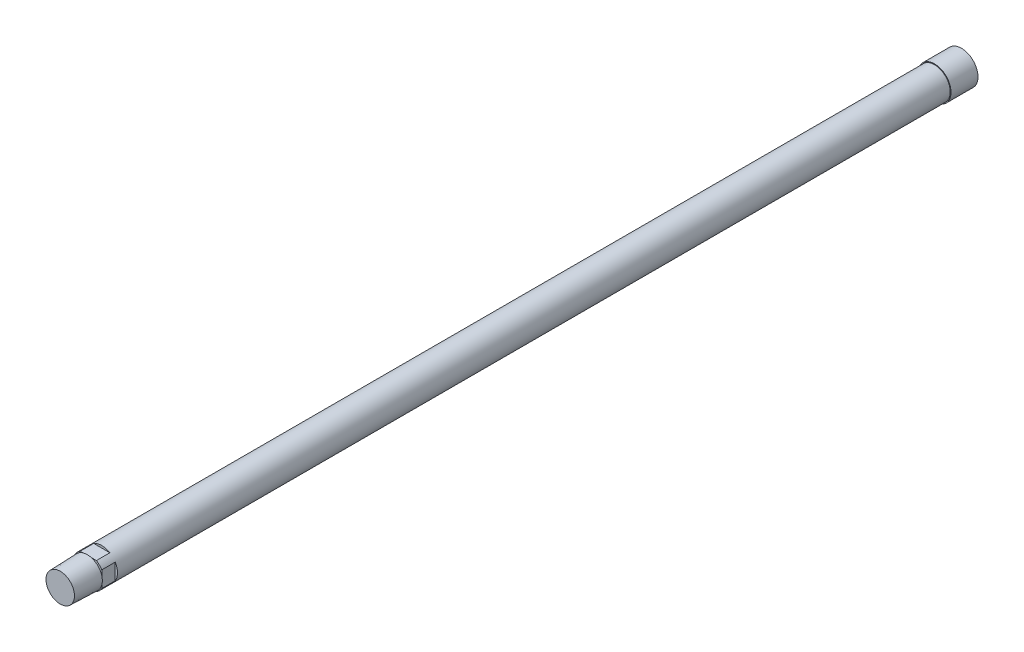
from build123d import *

# Parameters (mm, degrees)
SKETCH1_R          = 11.1125
SKETCH1_R_2        = 6.35
BASE_EXTRUDE_DEPTH = 617.8804
SKETCH8_R          = 7.62
CUT_EXTRUDE4_DEPTH = 7.62
SKETCH11_R         = 15.875
SKETCH11_W         = 19.05
SKETCH11_H         = 19.05
CUT_EXTRUDE5_DEPTH = 9.525
SKETCH14_R         = 11.684
WEB_EXTRUDE1_DEPTH = 19.05


with BuildPart() as part:
    # Sketch1 → Base-Extrude (new body)
    with BuildSketch(Plane.XY):
        with Locations(Location((0, 0, 0), (0, 0, 180))):
            Circle(SKETCH1_R)
        with Locations(Location((0, 0, 0), (0, 0, 180))):
            Circle(SKETCH1_R_2, mode=Mode.SUBTRACT)
    extrude(amount=BASE_EXTRUDE_DEPTH)

    # Sketch8 → Cut-Extrude4 (cut)
    with BuildSketch(Plane(origin=(0, 0, 0), x_dir=(-1, 0, 0), z_dir=(0, 0, -1))):
        Circle(SKETCH8_R)
    extrude(amount=-CUT_EXTRUDE4_DEPTH, mode=Mode.SUBTRACT)

    # Sketch9 → Cut-Revolve1 (revolve, cut)
    with BuildSketch(Plane(origin=(0, 0, 0), x_dir=(0, 0, -1), z_dir=(1, 0, 0)), mode=Mode.PRIVATE) as cut_revolve1_sk:
        Polygon((-617.8804, 8.9027), (-616.9787, 10.378522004), (-616.077, 8.958744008), (-615.1753, 10.434566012), (-614.2736, 9.014788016), (-613.3719, 10.49061002), (-612.4702, 9.070832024), (-611.5685, 10.546654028), (-610.6668, 9.126876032), (-609.7651, 10.602698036), (-608.8634, 9.18292004), (-607.9617, 10.658742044), (-607.06, 9.238964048), (-606.1583, 10.714786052), (-605.2566, 9.295008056), (-604.3549, 10.77083006), (-603.4532, 9.351052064), (-602.5515, 10.826874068), (-601.6498, 9.407096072), (-600.7481, 10.882918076), (-599.8464, 9.46314008), (-598.9447, 10.938962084), (-598.043, 9.519184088), (-598.043, 11.1125), (-617.8804, 11.1125), align=None)
    revolve(cut_revolve1_sk.sketch.rotate(Axis((0, 0, 617.8804), (0, 0, -1)), 90), axis=Axis((0, 0, 617.8804), (0, 0, -1)), mode=Mode.SUBTRACT)

    # Sketch10 → Cut-Revolve2 (revolve, cut)
    with BuildSketch(Plane(origin=(0, 0, 0), x_dir=(0, 0, -1), z_dir=(1, 0, 0)), mode=Mode.PRIVATE) as cut_revolve2_sk:
        Polygon((-617.8804, 11.1125), (-598.043, 11.1125), (-598.043, 10.668), (-617.8804, 10.051515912), align=None)
    revolve(cut_revolve2_sk.sketch.rotate(Axis((0, 0, 617.8804), (0, 0, -1)), 90), axis=Axis((0, 0, 617.8804), (0, 0, -1)), mode=Mode.SUBTRACT)

    # Sketch11 → Cut-Extrude5 (cut)
    with BuildSketch(Plane.XY.offset(598.043)):
        Circle(SKETCH11_R)
        Rectangle(SKETCH11_W, SKETCH11_H, mode=Mode.SUBTRACT)
    extrude(amount=-CUT_EXTRUDE5_DEPTH, mode=Mode.SUBTRACT)

    # Sketch13 → WEB Revolve1 (revolve)
    with BuildSketch(Plane(origin=(0, 0, 0), x_dir=(0, 0, -1), z_dir=(1, 0, 0)), mode=Mode.PRIVATE) as web_revolve1_sk:
        Polygon((-617.8804, 10.051515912), (-598.758490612, 10.645764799), (-598.043, 9.519184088), (-598.043, 6.35), (-7.62, 6.35), (-7.62, 11.1125), (0, 11.1125), (0, 0), (-617.8804, 0), align=None)
    revolve(web_revolve1_sk.sketch.rotate(Axis((0, 0, 118.728497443), (0, 0, -1)), 301.002719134), axis=Axis((0, 0, 118.728497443), (0, 0, -1)))

    # Sketch14 → WEB Extrude1 (add)
    with BuildSketch(Plane(origin=(0, 0, 0), x_dir=(-1, 0, 0), z_dir=(0, 0, -1))):
        with Locations(Location((0, 0, 0), (0, 0, 180))):
            Circle(SKETCH14_R)
    extrude(amount=WEB_EXTRUDE1_DEPTH)


solid = part.part
